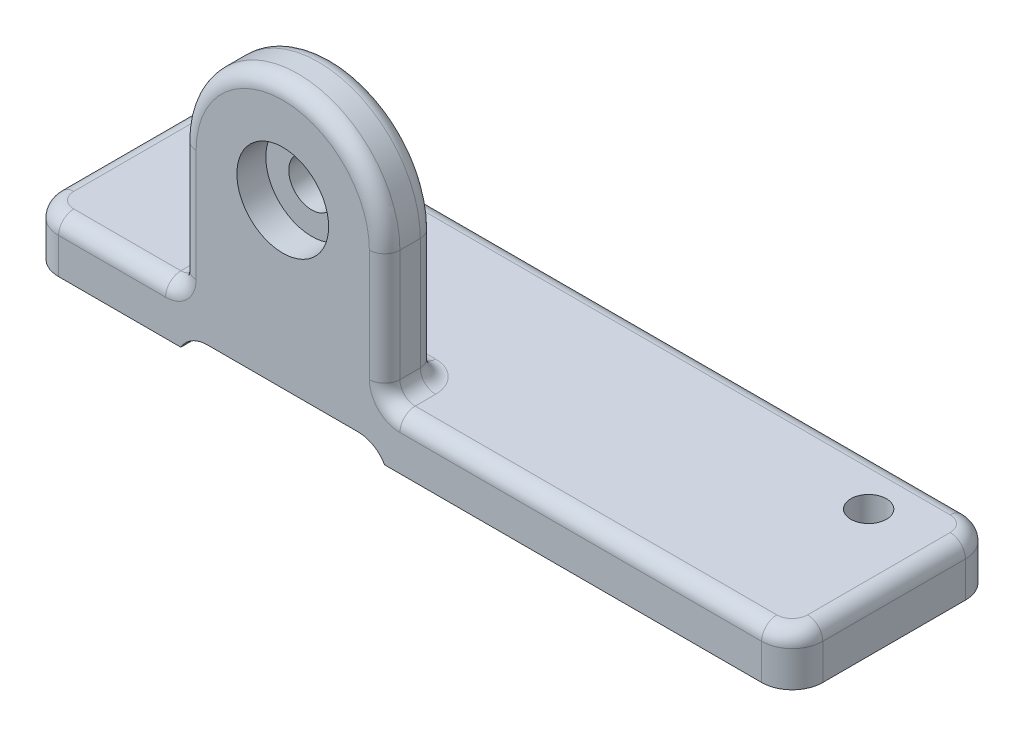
ISO-10303-21;
HEADER;
FILE_DESCRIPTION(('STEP AP214'),'2;1');
FILE_NAME('part.step','',(''),(''),'','','');
FILE_SCHEMA(('AUTOMOTIVE_DESIGN { 1 0 10303 214 1 1 1 1 }'));
ENDSEC;
DATA;
#1=APPLICATION_CONTEXT('core data for automotive mechanical design processes');
#2=APPLICATION_PROTOCOL_DEFINITION('international standard','automotive_design',2000,#1);
#3=PRODUCT_CONTEXT('',#1,'mechanical');
#4=PRODUCT('Part','Part','',(#3));
#5=PRODUCT_RELATED_PRODUCT_CATEGORY('part','',(#4));
#6=PRODUCT_DEFINITION_FORMATION('','',#4);
#7=PRODUCT_DEFINITION_CONTEXT('part definition',#1,'design');
#8=PRODUCT_DEFINITION('design','',#6,#7);
#9=PRODUCT_DEFINITION_SHAPE('','',#8);
#10=(LENGTH_UNIT() NAMED_UNIT(*) SI_UNIT(.MILLI.,.METRE.));
#11=(NAMED_UNIT(*) PLANE_ANGLE_UNIT() SI_UNIT($,.RADIAN.));
#12=(NAMED_UNIT(*) SI_UNIT($,.STERADIAN.) SOLID_ANGLE_UNIT());
#13=UNCERTAINTY_MEASURE_WITH_UNIT(LENGTH_MEASURE(1.E-05),#10,'distance_accuracy_value','');
#14=(GEOMETRIC_REPRESENTATION_CONTEXT(3) GLOBAL_UNCERTAINTY_ASSIGNED_CONTEXT((#13)) GLOBAL_UNIT_ASSIGNED_CONTEXT((#10,
#11,#12)) REPRESENTATION_CONTEXT('',''));
#15=CARTESIAN_POINT('',(0.,0.,0.));
#16=DIRECTION('',(0.,0.,1.));
#17=DIRECTION('',(1.,0.,0.));
#18=AXIS2_PLACEMENT_3D('',#15,#16,#17);
#19=CARTESIAN_POINT('',(0.,10.,-40.));
#20=DIRECTION('',(0.,-1.,0.));
#21=DIRECTION('',(0.,0.,-1.));
#22=AXIS2_PLACEMENT_3D('',#19,#20,#21);
#23=PLANE('',#22);
#24=DIRECTION('',(-1.,0.,0.));
#25=VECTOR('',#24,1.);
#26=CARTESIAN_POINT('',(0.,10.,-37.));
#27=LINE('',#26,#25);
#28=CARTESIAN_POINT('',(144.,10.,-37.));
#29=VERTEX_POINT('',#28);
#30=CARTESIAN_POINT('',(6.,10.,-37.));
#31=VERTEX_POINT('',#30);
#32=EDGE_CURVE('E334',#29,#31,#27,.T.);
#33=ORIENTED_EDGE('',*,*,#32,.T.);
#34=CARTESIAN_POINT('',(6.,10.,-34.));
#35=DIRECTION('',(0.,-1.,0.));
#36=DIRECTION('',(0.,0.,-1.));
#37=AXIS2_PLACEMENT_3D('',#34,#35,#36);
#38=CIRCLE('',#37,3.);
#39=CARTESIAN_POINT('',(3.,10.,-34.));
#40=VERTEX_POINT('',#39);
#41=EDGE_CURVE('E338',#31,#40,#38,.F.);
#42=ORIENTED_EDGE('',*,*,#41,.T.);
#43=DIRECTION('',(0.,0.,1.));
#44=VECTOR('',#43,1.);
#45=CARTESIAN_POINT('',(3.,10.,-40.));
#46=LINE('',#45,#44);
#47=CARTESIAN_POINT('',(3.,10.,-6.));
#48=VERTEX_POINT('',#47);
#49=EDGE_CURVE('E336',#40,#48,#46,.T.);
#50=ORIENTED_EDGE('',*,*,#49,.T.);
#51=CARTESIAN_POINT('',(6.,10.,-6.));
#52=DIRECTION('',(0.,-1.,0.));
#53=DIRECTION('',(0.,0.,-1.));
#54=AXIS2_PLACEMENT_3D('',#51,#52,#53);
#55=CIRCLE('',#54,3.);
#56=CARTESIAN_POINT('',(6.,10.,-3.));
#57=VERTEX_POINT('',#56);
#58=EDGE_CURVE('E332',#48,#57,#55,.F.);
#59=ORIENTED_EDGE('',*,*,#58,.T.);
#60=DIRECTION('',(1.,0.,0.));
#61=VECTOR('',#60,1.);
#62=CARTESIAN_POINT('',(0.,10.,-3.));
#63=LINE('',#62,#61);
#64=CARTESIAN_POINT('',(27.,10.,-3.));
#65=VERTEX_POINT('',#64);
#66=EDGE_CURVE('E328',#57,#65,#63,.T.);
#67=ORIENTED_EDGE('',*,*,#66,.T.);
#68=DIRECTION('',(0.,0.,-1.));
#69=VECTOR('',#68,1.);
#70=CARTESIAN_POINT('',(27.,10.,-40.));
#71=LINE('',#70,#69);
#72=CARTESIAN_POINT('',(27.,10.,-7.));
#73=VERTEX_POINT('',#72);
#74=EDGE_CURVE('E324',#65,#73,#71,.T.);
#75=ORIENTED_EDGE('',*,*,#74,.T.);
#76=CARTESIAN_POINT('',(33.,10.,-7.));
#77=DIRECTION('',(0.,-1.,0.));
#78=DIRECTION('',(0.,0.,-1.));
#79=AXIS2_PLACEMENT_3D('',#76,#77,#78);
#80=CIRCLE('',#79,6.);
#81=CARTESIAN_POINT('',(33.,10.,-13.));
#82=VERTEX_POINT('',#81);
#83=EDGE_CURVE('E321',#82,#73,#80,.F.);
#84=ORIENTED_EDGE('',*,*,#83,.F.);
#85=DIRECTION('',(1.,0.,0.));
#86=VECTOR('',#85,1.);
#87=CARTESIAN_POINT('',(0.,10.,-13.));
#88=LINE('',#87,#86);
#89=CARTESIAN_POINT('',(67.,10.,-13.));
#90=VERTEX_POINT('',#89);
#91=EDGE_CURVE('E317',#82,#90,#88,.T.);
#92=ORIENTED_EDGE('',*,*,#91,.T.);
#93=CARTESIAN_POINT('',(67.,10.,-7.));
#94=DIRECTION('',(0.,-1.,0.));
#95=DIRECTION('',(0.,0.,-1.));
#96=AXIS2_PLACEMENT_3D('',#93,#94,#95);
#97=CIRCLE('',#96,6.);
#98=CARTESIAN_POINT('',(73.,10.,-7.));
#99=VERTEX_POINT('',#98);
#100=EDGE_CURVE('E314',#99,#90,#97,.F.);
#101=ORIENTED_EDGE('',*,*,#100,.F.);
#102=DIRECTION('',(0.,0.,1.));
#103=VECTOR('',#102,1.);
#104=CARTESIAN_POINT('',(73.,10.,-40.));
#105=LINE('',#104,#103);
#106=CARTESIAN_POINT('',(73.,10.,-3.));
#107=VERTEX_POINT('',#106);
#108=EDGE_CURVE('E233',#99,#107,#105,.T.);
#109=ORIENTED_EDGE('',*,*,#108,.T.);
#110=DIRECTION('',(1.,0.,0.));
#111=VECTOR('',#110,1.);
#112=CARTESIAN_POINT('',(0.,10.,-3.));
#113=LINE('',#112,#111);
#114=CARTESIAN_POINT('',(144.,10.,-3.));
#115=VERTEX_POINT('',#114);
#116=EDGE_CURVE('E312',#107,#115,#113,.T.);
#117=ORIENTED_EDGE('',*,*,#116,.T.);
#118=CARTESIAN_POINT('',(144.,10.,-6.));
#119=DIRECTION('',(0.,-1.,0.));
#120=DIRECTION('',(0.,0.,-1.));
#121=AXIS2_PLACEMENT_3D('',#118,#119,#120);
#122=CIRCLE('',#121,3.);
#123=CARTESIAN_POINT('',(147.,10.,-6.));
#124=VERTEX_POINT('',#123);
#125=EDGE_CURVE('E319',#115,#124,#122,.F.);
#126=ORIENTED_EDGE('',*,*,#125,.T.);
#127=DIRECTION('',(0.,0.,-1.));
#128=VECTOR('',#127,1.);
#129=CARTESIAN_POINT('',(147.,10.,-40.));
#130=LINE('',#129,#128);
#131=CARTESIAN_POINT('',(147.,10.,-34.));
#132=VERTEX_POINT('',#131);
#133=EDGE_CURVE('E326',#124,#132,#130,.T.);
#134=ORIENTED_EDGE('',*,*,#133,.T.);
#135=CARTESIAN_POINT('',(144.,10.,-34.));
#136=DIRECTION('',(0.,-1.,0.));
#137=DIRECTION('',(0.,0.,-1.));
#138=AXIS2_PLACEMENT_3D('',#135,#136,#137);
#139=CIRCLE('',#138,3.);
#140=EDGE_CURVE('E330',#132,#29,#139,.F.);
#141=ORIENTED_EDGE('',*,*,#140,.T.);
#142=EDGE_LOOP('',(#33,#42,#50,#59,#67,#75,#84,#92,#101,#109,#117,#126,#134,#141));
#143=FACE_BOUND('',#142,.T.);
#144=CARTESIAN_POINT('',(135.,10.,-30.));
#145=DIRECTION('',(0.,1.,0.));
#146=DIRECTION('',(0.,0.,1.));
#147=AXIS2_PLACEMENT_3D('',#144,#145,#146);
#148=CIRCLE('',#147,3.49999999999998);
#149=CARTESIAN_POINT('',(135.,10.,-26.5));
#150=VERTEX_POINT('',#149);
#151=EDGE_CURVE('E274',#150,#150,#148,.T.);
#152=ORIENTED_EDGE('',*,*,#151,.F.);
#153=EDGE_LOOP('',(#152));
#154=FACE_BOUND('',#153,.T.);
#155=CARTESIAN_POINT('',(15.,10.,-30.));
#156=DIRECTION('',(0.,1.,0.));
#157=DIRECTION('',(0.,0.,1.));
#158=AXIS2_PLACEMENT_3D('',#155,#156,#157);
#159=CIRCLE('',#158,3.49999999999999);
#160=CARTESIAN_POINT('',(15.,10.,-26.5));
#161=VERTEX_POINT('',#160);
#162=EDGE_CURVE('E481',#161,#161,#159,.T.);
#163=ORIENTED_EDGE('',*,*,#162,.F.);
#164=EDGE_LOOP('',(#163));
#165=FACE_BOUND('',#164,.T.);
#166=ADVANCED_FACE('F36',(#143,#154,#165),#23,.F.);
#167=CARTESIAN_POINT('',(0.,0.,-40.));
#168=DIRECTION('',(0.,-1.,0.));
#169=DIRECTION('',(0.,0.,-1.));
#170=AXIS2_PLACEMENT_3D('',#167,#168,#169);
#171=PLANE('',#170);
#172=CARTESIAN_POINT('',(15.,0.,-30.));
#173=DIRECTION('',(0.,1.,0.));
#174=DIRECTION('',(0.,0.,1.));
#175=AXIS2_PLACEMENT_3D('',#172,#173,#174);
#176=CIRCLE('',#175,3.5);
#177=CARTESIAN_POINT('',(15.,0.,-26.5));
#178=VERTEX_POINT('',#177);
#179=EDGE_CURVE('E484',#178,#178,#176,.T.);
#180=ORIENTED_EDGE('',*,*,#179,.T.);
#181=EDGE_LOOP('',(#180));
#182=FACE_BOUND('',#181,.T.);
#183=DIRECTION('',(1.,0.,0.));
#184=VECTOR('',#183,1.);
#185=CARTESIAN_POINT('',(0.,0.,0.));
#186=LINE('',#185,#184);
#187=CARTESIAN_POINT('',(6.,0.,0.));
#188=VERTEX_POINT('',#187);
#189=CARTESIAN_POINT('',(30.,0.,0.));
#190=VERTEX_POINT('',#189);
#191=EDGE_CURVE('E266',#188,#190,#186,.T.);
#192=ORIENTED_EDGE('',*,*,#191,.F.);
#193=CARTESIAN_POINT('',(6.,0.,-6.));
#194=DIRECTION('',(0.,-1.,0.));
#195=DIRECTION('',(0.,0.,-1.));
#196=AXIS2_PLACEMENT_3D('',#193,#194,#195);
#197=CIRCLE('',#196,6.);
#198=CARTESIAN_POINT('',(0.,0.,-6.));
#199=VERTEX_POINT('',#198);
#200=EDGE_CURVE('E286',#188,#199,#197,.T.);
#201=ORIENTED_EDGE('',*,*,#200,.T.);
#202=DIRECTION('',(0.,0.,1.));
#203=VECTOR('',#202,1.);
#204=CARTESIAN_POINT('',(0.,0.,0.));
#205=LINE('',#204,#203);
#206=CARTESIAN_POINT('',(0.,0.,-34.));
#207=VERTEX_POINT('',#206);
#208=EDGE_CURVE('E261',#207,#199,#205,.T.);
#209=ORIENTED_EDGE('',*,*,#208,.F.);
#210=CARTESIAN_POINT('',(6.,0.,-34.));
#211=DIRECTION('',(0.,-1.,0.));
#212=DIRECTION('',(0.,0.,-1.));
#213=AXIS2_PLACEMENT_3D('',#210,#211,#212);
#214=CIRCLE('',#213,6.);
#215=CARTESIAN_POINT('',(6.,0.,-40.));
#216=VERTEX_POINT('',#215);
#217=EDGE_CURVE('E243',#207,#216,#214,.T.);
#218=ORIENTED_EDGE('',*,*,#217,.T.);
#219=DIRECTION('',(-1.,0.,0.));
#220=VECTOR('',#219,1.);
#221=CARTESIAN_POINT('',(0.,0.,-40.));
#222=LINE('',#221,#220);
#223=CARTESIAN_POINT('',(30.,0.,-40.));
#224=VERTEX_POINT('',#223);
#225=EDGE_CURVE('E226',#224,#216,#222,.T.);
#226=ORIENTED_EDGE('',*,*,#225,.F.);
#227=DIRECTION('',(0.,0.,1.));
#228=VECTOR('',#227,1.);
#229=CARTESIAN_POINT('',(30.,0.,-40.));
#230=LINE('',#229,#228);
#231=EDGE_CURVE('E240',#224,#190,#230,.T.);
#232=ORIENTED_EDGE('',*,*,#231,.T.);
#233=EDGE_LOOP('',(#192,#201,#209,#218,#226,#232));
#234=FACE_BOUND('',#233,.T.);
#235=ADVANCED_FACE('F239',(#182,#234),#171,.T.);
#236=CARTESIAN_POINT('',(0.,10.,0.));
#237=DIRECTION('',(1.,0.,0.));
#238=DIRECTION('',(0.,0.,-1.));
#239=AXIS2_PLACEMENT_3D('',#236,#237,#238);
#240=PLANE('',#239);
#241=DIRECTION('',(0.,-1.,0.));
#242=VECTOR('',#241,1.);
#243=CARTESIAN_POINT('',(0.,10.,-6.));
#244=LINE('',#243,#242);
#245=CARTESIAN_POINT('',(0.,7.,-6.));
#246=VERTEX_POINT('',#245);
#247=EDGE_CURVE('E290',#199,#246,#244,.F.);
#248=ORIENTED_EDGE('',*,*,#247,.T.);
#249=DIRECTION('',(0.,0.,1.));
#250=VECTOR('',#249,1.);
#251=CARTESIAN_POINT('',(0.,7.,0.));
#252=LINE('',#251,#250);
#253=CARTESIAN_POINT('',(0.,7.,-34.));
#254=VERTEX_POINT('',#253);
#255=EDGE_CURVE('E344',#246,#254,#252,.F.);
#256=ORIENTED_EDGE('',*,*,#255,.T.);
#257=DIRECTION('',(0.,-1.,0.));
#258=VECTOR('',#257,1.);
#259=CARTESIAN_POINT('',(0.,10.,-34.));
#260=LINE('',#259,#258);
#261=EDGE_CURVE('E288',#254,#207,#260,.T.);
#262=ORIENTED_EDGE('',*,*,#261,.T.);
#263=ORIENTED_EDGE('',*,*,#208,.T.);
#264=EDGE_LOOP('',(#248,#256,#262,#263));
#265=FACE_BOUND('',#264,.T.);
#266=ADVANCED_FACE('F500',(#265),#240,.F.);
#267=CARTESIAN_POINT('',(0.,10.,0.));
#268=DIRECTION('',(0.,0.,-1.));
#269=DIRECTION('',(-1.,0.,0.));
#270=AXIS2_PLACEMENT_3D('',#267,#268,#269);
#271=PLANE('',#270);
#272=CARTESIAN_POINT('',(50.,35.,0.));
#273=DIRECTION('',(0.,0.,1.));
#274=DIRECTION('',(1.,0.,0.));
#275=AXIS2_PLACEMENT_3D('',#272,#273,#274);
#276=CIRCLE('',#275,9.005);
#277=CARTESIAN_POINT('',(59.005,35.,0.));
#278=VERTEX_POINT('',#277);
#279=EDGE_CURVE('E275',#278,#278,#276,.T.);
#280=ORIENTED_EDGE('',*,*,#279,.F.);
#281=EDGE_LOOP('',(#280));
#282=FACE_BOUND('',#281,.T.);
#283=CARTESIAN_POINT('',(27.,13.,0.));
#284=DIRECTION('',(0.,0.,-1.));
#285=DIRECTION('',(-1.,0.,0.));
#286=AXIS2_PLACEMENT_3D('',#283,#284,#285);
#287=CIRCLE('',#286,6.);
#288=CARTESIAN_POINT('',(27.,7.,0.));
#289=VERTEX_POINT('',#288);
#290=CARTESIAN_POINT('',(33.,13.,0.));
#291=VERTEX_POINT('',#290);
#292=EDGE_CURVE('E363',#289,#291,#287,.F.);
#293=ORIENTED_EDGE('',*,*,#292,.F.);
#294=DIRECTION('',(1.,0.,0.));
#295=VECTOR('',#294,1.);
#296=CARTESIAN_POINT('',(0.,7.,0.));
#297=LINE('',#296,#295);
#298=CARTESIAN_POINT('',(6.,7.,0.));
#299=VERTEX_POINT('',#298);
#300=EDGE_CURVE('E366',#289,#299,#297,.F.);
#301=ORIENTED_EDGE('',*,*,#300,.T.);
#302=DIRECTION('',(0.,-1.,0.));
#303=VECTOR('',#302,1.);
#304=CARTESIAN_POINT('',(6.,10.,0.));
#305=LINE('',#304,#303);
#306=EDGE_CURVE('E283',#299,#188,#305,.T.);
#307=ORIENTED_EDGE('',*,*,#306,.T.);
#308=ORIENTED_EDGE('',*,*,#191,.T.);
#309=CARTESIAN_POINT('',(35.1961524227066,-3.,0.));
#310=DIRECTION('',(0.,0.,-1.));
#311=DIRECTION('',(-1.,0.,0.));
#312=AXIS2_PLACEMENT_3D('',#309,#310,#311);
#313=CIRCLE('',#312,6.);
#314=CARTESIAN_POINT('',(35.1961524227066,3.,0.));
#315=VERTEX_POINT('',#314);
#316=EDGE_CURVE('E234',#190,#315,#313,.T.);
#317=ORIENTED_EDGE('',*,*,#316,.T.);
#318=DIRECTION('',(-1.,0.,0.));
#319=VECTOR('',#318,1.);
#320=CARTESIAN_POINT('',(30.,3.,0.));
#321=LINE('',#320,#319);
#322=CARTESIAN_POINT('',(64.8038475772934,3.,0.));
#323=VERTEX_POINT('',#322);
#324=EDGE_CURVE('E254',#323,#315,#321,.T.);
#325=ORIENTED_EDGE('',*,*,#324,.F.);
#326=CARTESIAN_POINT('',(64.8038475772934,-3.,0.));
#327=DIRECTION('',(0.,0.,-1.));
#328=DIRECTION('',(-1.,0.,0.));
#329=AXIS2_PLACEMENT_3D('',#326,#327,#328);
#330=CIRCLE('',#329,6.);
#331=CARTESIAN_POINT('',(70.,0.,0.));
#332=VERTEX_POINT('',#331);
#333=EDGE_CURVE('E306',#323,#332,#330,.T.);
#334=ORIENTED_EDGE('',*,*,#333,.T.);
#335=CARTESIAN_POINT('',(144.,0.,0.));
#336=VERTEX_POINT('',#335);
#337=EDGE_CURVE('E265',#332,#336,#186,.T.);
#338=ORIENTED_EDGE('',*,*,#337,.T.);
#339=DIRECTION('',(0.,-1.,0.));
#340=VECTOR('',#339,1.);
#341=CARTESIAN_POINT('',(144.,10.,0.));
#342=LINE('',#341,#340);
#343=CARTESIAN_POINT('',(144.,7.,0.));
#344=VERTEX_POINT('',#343);
#345=EDGE_CURVE('E280',#336,#344,#342,.F.);
#346=ORIENTED_EDGE('',*,*,#345,.T.);
#347=DIRECTION('',(1.,0.,0.));
#348=VECTOR('',#347,1.);
#349=CARTESIAN_POINT('',(0.,7.,0.));
#350=LINE('',#349,#348);
#351=CARTESIAN_POINT('',(73.,7.,0.));
#352=VERTEX_POINT('',#351);
#353=EDGE_CURVE('E361',#344,#352,#350,.F.);
#354=ORIENTED_EDGE('',*,*,#353,.T.);
#355=CARTESIAN_POINT('',(73.,13.,0.));
#356=DIRECTION('',(0.,0.,-1.));
#357=DIRECTION('',(-1.,0.,0.));
#358=AXIS2_PLACEMENT_3D('',#355,#356,#357);
#359=CIRCLE('',#358,6.);
#360=CARTESIAN_POINT('',(67.,13.,0.));
#361=VERTEX_POINT('',#360);
#362=EDGE_CURVE('E358',#361,#352,#359,.F.);
#363=ORIENTED_EDGE('',*,*,#362,.F.);
#364=DIRECTION('',(0.,1.,0.));
#365=VECTOR('',#364,1.);
#366=CARTESIAN_POINT('',(67.,35.,0.));
#367=LINE('',#366,#365);
#368=CARTESIAN_POINT('',(67.,35.,0.));
#369=VERTEX_POINT('',#368);
#370=EDGE_CURVE('E356',#361,#369,#367,.T.);
#371=ORIENTED_EDGE('',*,*,#370,.T.);
#372=CARTESIAN_POINT('',(50.,35.,0.));
#373=DIRECTION('',(0.,0.,-1.));
#374=DIRECTION('',(-1.,0.,0.));
#375=AXIS2_PLACEMENT_3D('',#372,#373,#374);
#376=CIRCLE('',#375,17.);
#377=CARTESIAN_POINT('',(33.,35.,0.));
#378=VERTEX_POINT('',#377);
#379=EDGE_CURVE('E352',#369,#378,#376,.F.);
#380=ORIENTED_EDGE('',*,*,#379,.T.);
#381=DIRECTION('',(0.,-1.,0.));
#382=VECTOR('',#381,1.);
#383=CARTESIAN_POINT('',(33.,10.,0.));
#384=LINE('',#383,#382);
#385=EDGE_CURVE('E354',#378,#291,#384,.T.);
#386=ORIENTED_EDGE('',*,*,#385,.T.);
#387=EDGE_LOOP('',(#293,#301,#307,#308,#317,#325,#334,#338,#346,#354,#363,#371,#380,#386));
#388=FACE_BOUND('',#387,.T.);
#389=ADVANCED_FACE('F492',(#282,#388),#271,.F.);
#390=CARTESIAN_POINT('',(150.,10.,0.));
#391=DIRECTION('',(-1.,0.,0.));
#392=DIRECTION('',(0.,0.,1.));
#393=AXIS2_PLACEMENT_3D('',#390,#391,#392);
#394=PLANE('',#393);
#395=DIRECTION('',(0.,-1.,0.));
#396=VECTOR('',#395,1.);
#397=CARTESIAN_POINT('',(150.,10.,-34.));
#398=LINE('',#397,#396);
#399=CARTESIAN_POINT('',(150.,0.,-34.));
#400=VERTEX_POINT('',#399);
#401=CARTESIAN_POINT('',(150.,7.,-34.));
#402=VERTEX_POINT('',#401);
#403=EDGE_CURVE('E303',#400,#402,#398,.F.);
#404=ORIENTED_EDGE('',*,*,#403,.T.);
#405=DIRECTION('',(0.,0.,-1.));
#406=VECTOR('',#405,1.);
#407=CARTESIAN_POINT('',(150.,7.,0.));
#408=LINE('',#407,#406);
#409=CARTESIAN_POINT('',(150.,7.,-6.));
#410=VERTEX_POINT('',#409);
#411=EDGE_CURVE('E368',#402,#410,#408,.F.);
#412=ORIENTED_EDGE('',*,*,#411,.T.);
#413=DIRECTION('',(0.,-1.,0.));
#414=VECTOR('',#413,1.);
#415=CARTESIAN_POINT('',(150.,10.,-6.));
#416=LINE('',#415,#414);
#417=CARTESIAN_POINT('',(150.,0.,-6.));
#418=VERTEX_POINT('',#417);
#419=EDGE_CURVE('E301',#410,#418,#416,.T.);
#420=ORIENTED_EDGE('',*,*,#419,.T.);
#421=DIRECTION('',(0.,0.,-1.));
#422=VECTOR('',#421,1.);
#423=CARTESIAN_POINT('',(150.,0.,0.));
#424=LINE('',#423,#422);
#425=EDGE_CURVE('E245',#418,#400,#424,.T.);
#426=ORIENTED_EDGE('',*,*,#425,.T.);
#427=EDGE_LOOP('',(#404,#412,#420,#426));
#428=FACE_BOUND('',#427,.T.);
#429=ADVANCED_FACE('F544',(#428),#394,.F.);
#430=CARTESIAN_POINT('',(0.,10.,-40.));
#431=DIRECTION('',(0.,0.,1.));
#432=DIRECTION('',(1.,0.,0.));
#433=AXIS2_PLACEMENT_3D('',#430,#431,#432);
#434=PLANE('',#433);
#435=DIRECTION('',(0.,-1.,0.));
#436=VECTOR('',#435,1.);
#437=CARTESIAN_POINT('',(6.,10.,-40.));
#438=LINE('',#437,#436);
#439=CARTESIAN_POINT('',(6.,7.,-40.));
#440=VERTEX_POINT('',#439);
#441=EDGE_CURVE('E295',#216,#440,#438,.F.);
#442=ORIENTED_EDGE('',*,*,#441,.T.);
#443=DIRECTION('',(-1.,0.,0.));
#444=VECTOR('',#443,1.);
#445=CARTESIAN_POINT('',(0.,7.,-40.));
#446=LINE('',#445,#444);
#447=CARTESIAN_POINT('',(144.,7.,-40.));
#448=VERTEX_POINT('',#447);
#449=EDGE_CURVE('E346',#440,#448,#446,.F.);
#450=ORIENTED_EDGE('',*,*,#449,.T.);
#451=DIRECTION('',(0.,-1.,0.));
#452=VECTOR('',#451,1.);
#453=CARTESIAN_POINT('',(144.,10.,-40.));
#454=LINE('',#453,#452);
#455=CARTESIAN_POINT('',(144.,0.,-40.));
#456=VERTEX_POINT('',#455);
#457=EDGE_CURVE('E293',#448,#456,#454,.T.);
#458=ORIENTED_EDGE('',*,*,#457,.T.);
#459=CARTESIAN_POINT('',(70.,0.,-40.));
#460=VERTEX_POINT('',#459);
#461=EDGE_CURVE('E244',#456,#460,#222,.T.);
#462=ORIENTED_EDGE('',*,*,#461,.T.);
#463=CARTESIAN_POINT('',(64.8038475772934,-3.,-40.));
#464=DIRECTION('',(0.,0.,1.));
#465=DIRECTION('',(1.,0.,0.));
#466=AXIS2_PLACEMENT_3D('',#463,#464,#465);
#467=CIRCLE('',#466,6.);
#468=CARTESIAN_POINT('',(64.8038475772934,3.,-40.));
#469=VERTEX_POINT('',#468);
#470=EDGE_CURVE('E308',#460,#469,#467,.T.);
#471=ORIENTED_EDGE('',*,*,#470,.T.);
#472=DIRECTION('',(-1.,0.,0.));
#473=VECTOR('',#472,1.);
#474=CARTESIAN_POINT('',(30.,3.,-40.));
#475=LINE('',#474,#473);
#476=CARTESIAN_POINT('',(35.1961524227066,3.,-40.));
#477=VERTEX_POINT('',#476);
#478=EDGE_CURVE('E229',#469,#477,#475,.T.);
#479=ORIENTED_EDGE('',*,*,#478,.T.);
#480=CARTESIAN_POINT('',(35.1961524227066,-3.,-40.));
#481=DIRECTION('',(0.,0.,1.));
#482=DIRECTION('',(1.,0.,0.));
#483=AXIS2_PLACEMENT_3D('',#480,#481,#482);
#484=CIRCLE('',#483,6.);
#485=EDGE_CURVE('E222',#477,#224,#484,.T.);
#486=ORIENTED_EDGE('',*,*,#485,.T.);
#487=ORIENTED_EDGE('',*,*,#225,.T.);
#488=EDGE_LOOP('',(#442,#450,#458,#462,#471,#479,#486,#487));
#489=FACE_BOUND('',#488,.T.);
#490=ADVANCED_FACE('F225',(#489),#434,.F.);
#491=CARTESIAN_POINT('',(135.,0.,-30.));
#492=DIRECTION('',(0.,1.,0.));
#493=DIRECTION('',(0.,0.,1.));
#494=AXIS2_PLACEMENT_3D('',#491,#492,#493);
#495=CIRCLE('',#494,3.5);
#496=CARTESIAN_POINT('',(135.,0.,-26.5));
#497=VERTEX_POINT('',#496);
#498=EDGE_CURVE('E478',#497,#497,#495,.T.);
#499=ORIENTED_EDGE('',*,*,#498,.T.);
#500=EDGE_LOOP('',(#499));
#501=FACE_BOUND('',#500,.T.);
#502=ORIENTED_EDGE('',*,*,#461,.F.);
#503=CARTESIAN_POINT('',(144.,0.,-34.));
#504=DIRECTION('',(0.,-1.,0.));
#505=DIRECTION('',(0.,0.,-1.));
#506=AXIS2_PLACEMENT_3D('',#503,#504,#505);
#507=CIRCLE('',#506,6.);
#508=EDGE_CURVE('E299',#456,#400,#507,.T.);
#509=ORIENTED_EDGE('',*,*,#508,.T.);
#510=ORIENTED_EDGE('',*,*,#425,.F.);
#511=CARTESIAN_POINT('',(144.,0.,-6.));
#512=DIRECTION('',(0.,-1.,0.));
#513=DIRECTION('',(0.,0.,-1.));
#514=AXIS2_PLACEMENT_3D('',#511,#512,#513);
#515=CIRCLE('',#514,6.);
#516=EDGE_CURVE('E297',#418,#336,#515,.T.);
#517=ORIENTED_EDGE('',*,*,#516,.T.);
#518=ORIENTED_EDGE('',*,*,#337,.F.);
#519=DIRECTION('',(0.,0.,1.));
#520=VECTOR('',#519,1.);
#521=CARTESIAN_POINT('',(70.,0.,-40.));
#522=LINE('',#521,#520);
#523=EDGE_CURVE('E249',#460,#332,#522,.T.);
#524=ORIENTED_EDGE('',*,*,#523,.F.);
#525=EDGE_LOOP('',(#502,#509,#510,#517,#518,#524));
#526=FACE_BOUND('',#525,.T.);
#527=ADVANCED_FACE('F623',(#501,#526),#171,.T.);
#528=CARTESIAN_POINT('',(30.,0.,-10.));
#529=DIRECTION('',(-1.,0.,0.));
#530=DIRECTION('',(0.,-1.,0.));
#531=AXIS2_PLACEMENT_3D('',#528,#529,#530);
#532=PLANE('',#531);
#533=DIRECTION('',(0.,0.,1.));
#534=VECTOR('',#533,1.);
#535=CARTESIAN_POINT('',(30.,35.,-10.));
#536=LINE('',#535,#534);
#537=CARTESIAN_POINT('',(30.,35.,-7.));
#538=VERTEX_POINT('',#537);
#539=CARTESIAN_POINT('',(30.,35.,-3.));
#540=VERTEX_POINT('',#539);
#541=EDGE_CURVE('E258',#538,#540,#536,.T.);
#542=ORIENTED_EDGE('',*,*,#541,.F.);
#543=DIRECTION('',(0.,-1.,0.));
#544=VECTOR('',#543,1.);
#545=CARTESIAN_POINT('',(30.,0.,-7.));
#546=LINE('',#545,#544);
#547=CARTESIAN_POINT('',(30.,13.,-7.));
#548=VERTEX_POINT('',#547);
#549=EDGE_CURVE('E375',#538,#548,#546,.T.);
#550=ORIENTED_EDGE('',*,*,#549,.T.);
#551=DIRECTION('',(0.,0.,-1.));
#552=VECTOR('',#551,1.);
#553=CARTESIAN_POINT('',(30.,13.,-10.));
#554=LINE('',#553,#552);
#555=CARTESIAN_POINT('',(30.,13.,-3.));
#556=VERTEX_POINT('',#555);
#557=EDGE_CURVE('E372',#548,#556,#554,.F.);
#558=ORIENTED_EDGE('',*,*,#557,.T.);
#559=DIRECTION('',(0.,-1.,0.));
#560=VECTOR('',#559,1.);
#561=CARTESIAN_POINT('',(30.,35.,-3.));
#562=LINE('',#561,#560);
#563=EDGE_CURVE('E370',#556,#540,#562,.F.);
#564=ORIENTED_EDGE('',*,*,#563,.T.);
#565=EDGE_LOOP('',(#542,#550,#558,#564));
#566=FACE_BOUND('',#565,.T.);
#567=ADVANCED_FACE('F629',(#566),#532,.T.);
#568=CARTESIAN_POINT('',(70.,35.,-10.));
#569=DIRECTION('',(1.,0.,0.));
#570=DIRECTION('',(0.,0.,-1.));
#571=AXIS2_PLACEMENT_3D('',#568,#569,#570);
#572=PLANE('',#571);
#573=DIRECTION('',(0.,0.,1.));
#574=VECTOR('',#573,1.);
#575=CARTESIAN_POINT('',(70.,13.,-10.));
#576=LINE('',#575,#574);
#577=CARTESIAN_POINT('',(70.,13.,-3.));
#578=VERTEX_POINT('',#577);
#579=CARTESIAN_POINT('',(70.,13.,-7.));
#580=VERTEX_POINT('',#579);
#581=EDGE_CURVE('E53',#578,#580,#576,.F.);
#582=ORIENTED_EDGE('',*,*,#581,.T.);
#583=DIRECTION('',(0.,1.,0.));
#584=VECTOR('',#583,1.);
#585=CARTESIAN_POINT('',(70.,35.,-7.));
#586=LINE('',#585,#584);
#587=CARTESIAN_POINT('',(70.,35.,-7.));
#588=VERTEX_POINT('',#587);
#589=EDGE_CURVE('E390',#580,#588,#586,.T.);
#590=ORIENTED_EDGE('',*,*,#589,.T.);
#591=DIRECTION('',(0.,0.,1.));
#592=VECTOR('',#591,1.);
#593=CARTESIAN_POINT('',(70.,35.,-10.));
#594=LINE('',#593,#592);
#595=CARTESIAN_POINT('',(70.,35.,-3.));
#596=VERTEX_POINT('',#595);
#597=EDGE_CURVE('E252',#588,#596,#594,.T.);
#598=ORIENTED_EDGE('',*,*,#597,.T.);
#599=DIRECTION('',(0.,1.,0.));
#600=VECTOR('',#599,1.);
#601=CARTESIAN_POINT('',(70.,10.,-3.));
#602=LINE('',#601,#600);
#603=EDGE_CURVE('E58',#596,#578,#602,.F.);
#604=ORIENTED_EDGE('',*,*,#603,.T.);
#605=EDGE_LOOP('',(#582,#590,#598,#604));
#606=FACE_BOUND('',#605,.T.);
#607=ADVANCED_FACE('F625',(#606),#572,.T.);
#608=CARTESIAN_POINT('',(50.,35.,-10.));
#609=DIRECTION('',(0.,0.,-1.));
#610=DIRECTION('',(-1.,0.,0.));
#611=AXIS2_PLACEMENT_3D('',#608,#609,#610);
#612=PLANE('',#611);
#613=DIRECTION('',(0.,1.,0.));
#614=VECTOR('',#613,1.);
#615=CARTESIAN_POINT('',(67.,35.,-10.));
#616=LINE('',#615,#614);
#617=CARTESIAN_POINT('',(67.,35.,-10.));
#618=VERTEX_POINT('',#617);
#619=CARTESIAN_POINT('',(67.,13.,-10.));
#620=VERTEX_POINT('',#619);
#621=EDGE_CURVE('E383',#618,#620,#616,.F.);
#622=ORIENTED_EDGE('',*,*,#621,.T.);
#623=DIRECTION('',(1.,0.,0.));
#624=VECTOR('',#623,1.);
#625=CARTESIAN_POINT('',(50.,13.,-10.));
#626=LINE('',#625,#624);
#627=CARTESIAN_POINT('',(33.,13.,-10.));
#628=VERTEX_POINT('',#627);
#629=EDGE_CURVE('E385',#620,#628,#626,.F.);
#630=ORIENTED_EDGE('',*,*,#629,.T.);
#631=DIRECTION('',(0.,-1.,0.));
#632=VECTOR('',#631,1.);
#633=CARTESIAN_POINT('',(33.,35.,-10.));
#634=LINE('',#633,#632);
#635=CARTESIAN_POINT('',(33.,35.,-10.));
#636=VERTEX_POINT('',#635);
#637=EDGE_CURVE('E381',#628,#636,#634,.F.);
#638=ORIENTED_EDGE('',*,*,#637,.T.);
#639=CARTESIAN_POINT('',(50.,35.,-10.));
#640=DIRECTION('',(0.,0.,-1.));
#641=DIRECTION('',(-1.,0.,0.));
#642=AXIS2_PLACEMENT_3D('',#639,#640,#641);
#643=CIRCLE('',#642,17.);
#644=EDGE_CURVE('E379',#636,#618,#643,.T.);
#645=ORIENTED_EDGE('',*,*,#644,.T.);
#646=EDGE_LOOP('',(#622,#630,#638,#645));
#647=FACE_BOUND('',#646,.T.);
#648=CARTESIAN_POINT('',(50.,35.,-10.));
#649=DIRECTION('',(0.,0.,-1.));
#650=DIRECTION('',(-1.,0.,0.));
#651=AXIS2_PLACEMENT_3D('',#648,#649,#650);
#652=CIRCLE('',#651,4.5);
#653=CARTESIAN_POINT('',(45.5,35.,-10.));
#654=VERTEX_POINT('',#653);
#655=EDGE_CURVE('E271',#654,#654,#652,.T.);
#656=ORIENTED_EDGE('',*,*,#655,.F.);
#657=EDGE_LOOP('',(#656));
#658=FACE_BOUND('',#657,.T.);
#659=ADVANCED_FACE('F695',(#647,#658),#612,.T.);
#660=CARTESIAN_POINT('',(50.,35.,-10.));
#661=DIRECTION('',(0.,0.,1.));
#662=DIRECTION('',(1.,0.,0.));
#663=AXIS2_PLACEMENT_3D('',#660,#661,#662);
#664=CYLINDRICAL_SURFACE('',#663,20.);
#665=ORIENTED_EDGE('',*,*,#597,.F.);
#666=CARTESIAN_POINT('',(50.,35.,-7.));
#667=DIRECTION('',(0.,0.,-1.));
#668=DIRECTION('',(-1.,0.,0.));
#669=AXIS2_PLACEMENT_3D('',#666,#667,#668);
#670=CIRCLE('',#669,20.);
#671=EDGE_CURVE('E11',#588,#538,#670,.F.);
#672=ORIENTED_EDGE('',*,*,#671,.T.);
#673=ORIENTED_EDGE('',*,*,#541,.T.);
#674=CARTESIAN_POINT('',(50.,35.,-3.));
#675=DIRECTION('',(0.,0.,-1.));
#676=DIRECTION('',(-1.,0.,0.));
#677=AXIS2_PLACEMENT_3D('',#674,#675,#676);
#678=CIRCLE('',#677,20.);
#679=EDGE_CURVE('E45',#540,#596,#678,.T.);
#680=ORIENTED_EDGE('',*,*,#679,.T.);
#681=EDGE_LOOP('',(#665,#672,#673,#680));
#682=FACE_BOUND('',#681,.T.);
#683=ADVANCED_FACE('F700',(#682),#664,.T.);
#684=CARTESIAN_POINT('',(30.,3.,-40.));
#685=DIRECTION('',(0.,1.,0.));
#686=DIRECTION('',(0.,0.,1.));
#687=AXIS2_PLACEMENT_3D('',#684,#685,#686);
#688=PLANE('',#687);
#689=ORIENTED_EDGE('',*,*,#478,.F.);
#690=DIRECTION('',(0.,0.,-1.));
#691=VECTOR('',#690,1.);
#692=CARTESIAN_POINT('',(64.8038475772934,3.,-40.));
#693=LINE('',#692,#691);
#694=EDGE_CURVE('E277',#469,#323,#693,.F.);
#695=ORIENTED_EDGE('',*,*,#694,.T.);
#696=ORIENTED_EDGE('',*,*,#324,.T.);
#697=DIRECTION('',(0.,0.,1.));
#698=VECTOR('',#697,1.);
#699=CARTESIAN_POINT('',(35.1961524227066,3.,-40.));
#700=LINE('',#699,#698);
#701=EDGE_CURVE('E270',#315,#477,#700,.F.);
#702=ORIENTED_EDGE('',*,*,#701,.T.);
#703=EDGE_LOOP('',(#689,#695,#696,#702));
#704=FACE_BOUND('',#703,.T.);
#705=ADVANCED_FACE('F489',(#704),#688,.F.);
#706=CARTESIAN_POINT('',(15.,10.,-30.));
#707=DIRECTION('',(0.,1.,0.));
#708=DIRECTION('',(0.,0.,1.));
#709=AXIS2_PLACEMENT_3D('',#706,#707,#708);
#710=CYLINDRICAL_SURFACE('',#709,3.49999999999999);
#711=ORIENTED_EDGE('',*,*,#179,.F.);
#712=EDGE_LOOP('',(#711));
#713=FACE_BOUND('',#712,.T.);
#714=ORIENTED_EDGE('',*,*,#162,.T.);
#715=EDGE_LOOP('',(#714));
#716=FACE_BOUND('',#715,.T.);
#717=ADVANCED_FACE('F715',(#713,#716),#710,.F.);
#718=CARTESIAN_POINT('',(135.,10.,-30.));
#719=DIRECTION('',(0.,1.,0.));
#720=DIRECTION('',(0.,0.,1.));
#721=AXIS2_PLACEMENT_3D('',#718,#719,#720);
#722=CYLINDRICAL_SURFACE('',#721,3.49999999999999);
#723=ORIENTED_EDGE('',*,*,#498,.F.);
#724=EDGE_LOOP('',(#723));
#725=FACE_BOUND('',#724,.T.);
#726=ORIENTED_EDGE('',*,*,#151,.T.);
#727=EDGE_LOOP('',(#726));
#728=FACE_BOUND('',#727,.T.);
#729=ADVANCED_FACE('F818',(#725,#728),#722,.F.);
#730=CARTESIAN_POINT('',(50.,35.,0.));
#731=DIRECTION('',(0.,0.,1.));
#732=DIRECTION('',(1.,0.,0.));
#733=AXIS2_PLACEMENT_3D('',#730,#731,#732);
#734=CYLINDRICAL_SURFACE('',#733,9.005);
#735=CARTESIAN_POINT('',(50.,35.,-5.68));
#736=DIRECTION('',(0.,0.,1.));
#737=DIRECTION('',(1.,0.,0.));
#738=AXIS2_PLACEMENT_3D('',#735,#736,#737);
#739=CIRCLE('',#738,9.005);
#740=CARTESIAN_POINT('',(59.005,35.,-5.68));
#741=VERTEX_POINT('',#740);
#742=EDGE_CURVE('E467',#741,#741,#739,.T.);
#743=ORIENTED_EDGE('',*,*,#742,.F.);
#744=EDGE_LOOP('',(#743));
#745=FACE_BOUND('',#744,.T.);
#746=ORIENTED_EDGE('',*,*,#279,.T.);
#747=EDGE_LOOP('',(#746));
#748=FACE_BOUND('',#747,.T.);
#749=ADVANCED_FACE('F808',(#745,#748),#734,.F.);
#750=CARTESIAN_POINT('',(54.5,35.,-5.68));
#751=DIRECTION('',(0.,0.,-1.));
#752=DIRECTION('',(-1.,0.,0.));
#753=AXIS2_PLACEMENT_3D('',#750,#751,#752);
#754=PLANE('',#753);
#755=CARTESIAN_POINT('',(50.,35.,-5.68));
#756=DIRECTION('',(0.,0.,1.));
#757=DIRECTION('',(1.,0.,0.));
#758=AXIS2_PLACEMENT_3D('',#755,#756,#757);
#759=CIRCLE('',#758,4.5);
#760=CARTESIAN_POINT('',(54.5,35.,-5.68));
#761=VERTEX_POINT('',#760);
#762=EDGE_CURVE('E461',#761,#761,#759,.T.);
#763=ORIENTED_EDGE('',*,*,#762,.F.);
#764=EDGE_LOOP('',(#763));
#765=FACE_BOUND('',#764,.T.);
#766=ORIENTED_EDGE('',*,*,#742,.T.);
#767=EDGE_LOOP('',(#766));
#768=FACE_BOUND('',#767,.T.);
#769=ADVANCED_FACE('F798',(#765,#768),#754,.F.);
#770=CARTESIAN_POINT('',(50.,35.,0.));
#771=DIRECTION('',(0.,0.,1.));
#772=DIRECTION('',(1.,0.,0.));
#773=AXIS2_PLACEMENT_3D('',#770,#771,#772);
#774=CYLINDRICAL_SURFACE('',#773,4.5);
#775=ORIENTED_EDGE('',*,*,#655,.T.);
#776=EDGE_LOOP('',(#775));
#777=FACE_BOUND('',#776,.T.);
#778=ORIENTED_EDGE('',*,*,#762,.T.);
#779=EDGE_LOOP('',(#778));
#780=FACE_BOUND('',#779,.T.);
#781=ADVANCED_FACE('F643',(#777,#780),#774,.F.);
#782=CARTESIAN_POINT('',(64.8038475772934,-3.,-40.));
#783=DIRECTION('',(0.,0.,-1.));
#784=DIRECTION('',(-1.,0.,0.));
#785=AXIS2_PLACEMENT_3D('',#782,#783,#784);
#786=CYLINDRICAL_SURFACE('',#785,6.);
#787=ORIENTED_EDGE('',*,*,#470,.F.);
#788=ORIENTED_EDGE('',*,*,#523,.T.);
#789=ORIENTED_EDGE('',*,*,#333,.F.);
#790=ORIENTED_EDGE('',*,*,#694,.F.);
#791=EDGE_LOOP('',(#787,#788,#789,#790));
#792=FACE_BOUND('',#791,.T.);
#793=ADVANCED_FACE('F640',(#792),#786,.F.);
#794=CARTESIAN_POINT('',(35.1961524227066,-3.,-40.));
#795=DIRECTION('',(0.,0.,1.));
#796=DIRECTION('',(1.,0.,0.));
#797=AXIS2_PLACEMENT_3D('',#794,#795,#796);
#798=CYLINDRICAL_SURFACE('',#797,6.);
#799=ORIENTED_EDGE('',*,*,#485,.F.);
#800=ORIENTED_EDGE('',*,*,#701,.F.);
#801=ORIENTED_EDGE('',*,*,#316,.F.);
#802=ORIENTED_EDGE('',*,*,#231,.F.);
#803=EDGE_LOOP('',(#799,#800,#801,#802));
#804=FACE_BOUND('',#803,.T.);
#805=ADVANCED_FACE('F247',(#804),#798,.F.);
#806=CARTESIAN_POINT('',(6.,10.,-6.));
#807=DIRECTION('',(0.,-1.,0.));
#808=DIRECTION('',(0.,0.,-1.));
#809=AXIS2_PLACEMENT_3D('',#806,#807,#808);
#810=CYLINDRICAL_SURFACE('',#809,6.);
#811=ORIENTED_EDGE('',*,*,#306,.F.);
#812=CARTESIAN_POINT('',(6.,7.,-6.));
#813=DIRECTION('',(0.,-1.,0.));
#814=DIRECTION('',(0.,0.,-1.));
#815=AXIS2_PLACEMENT_3D('',#812,#813,#814);
#816=CIRCLE('',#815,6.);
#817=EDGE_CURVE('E348',#299,#246,#816,.T.);
#818=ORIENTED_EDGE('',*,*,#817,.T.);
#819=ORIENTED_EDGE('',*,*,#247,.F.);
#820=ORIENTED_EDGE('',*,*,#200,.F.);
#821=EDGE_LOOP('',(#811,#818,#819,#820));
#822=FACE_BOUND('',#821,.T.);
#823=ADVANCED_FACE('F503',(#822),#810,.T.);
#824=CARTESIAN_POINT('',(6.,10.,-34.));
#825=DIRECTION('',(0.,-1.,0.));
#826=DIRECTION('',(0.,0.,-1.));
#827=AXIS2_PLACEMENT_3D('',#824,#825,#826);
#828=CYLINDRICAL_SURFACE('',#827,6.);
#829=ORIENTED_EDGE('',*,*,#261,.F.);
#830=CARTESIAN_POINT('',(6.,7.,-34.));
#831=DIRECTION('',(0.,-1.,0.));
#832=DIRECTION('',(0.,0.,-1.));
#833=AXIS2_PLACEMENT_3D('',#830,#831,#832);
#834=CIRCLE('',#833,6.);
#835=EDGE_CURVE('E341',#254,#440,#834,.T.);
#836=ORIENTED_EDGE('',*,*,#835,.T.);
#837=ORIENTED_EDGE('',*,*,#441,.F.);
#838=ORIENTED_EDGE('',*,*,#217,.F.);
#839=EDGE_LOOP('',(#829,#836,#837,#838));
#840=FACE_BOUND('',#839,.T.);
#841=ADVANCED_FACE('F516',(#840),#828,.T.);
#842=CARTESIAN_POINT('',(144.,10.,-34.));
#843=DIRECTION('',(0.,-1.,0.));
#844=DIRECTION('',(0.,0.,-1.));
#845=AXIS2_PLACEMENT_3D('',#842,#843,#844);
#846=CYLINDRICAL_SURFACE('',#845,6.);
#847=ORIENTED_EDGE('',*,*,#457,.F.);
#848=CARTESIAN_POINT('',(144.,7.,-34.));
#849=DIRECTION('',(0.,-1.,0.));
#850=DIRECTION('',(0.,0.,-1.));
#851=AXIS2_PLACEMENT_3D('',#848,#849,#850);
#852=CIRCLE('',#851,6.);
#853=EDGE_CURVE('E350',#448,#402,#852,.T.);
#854=ORIENTED_EDGE('',*,*,#853,.T.);
#855=ORIENTED_EDGE('',*,*,#403,.F.);
#856=ORIENTED_EDGE('',*,*,#508,.F.);
#857=EDGE_LOOP('',(#847,#854,#855,#856));
#858=FACE_BOUND('',#857,.T.);
#859=ADVANCED_FACE('F530',(#858),#846,.T.);
#860=CARTESIAN_POINT('',(144.,10.,-6.));
#861=DIRECTION('',(0.,-1.,0.));
#862=DIRECTION('',(0.,0.,-1.));
#863=AXIS2_PLACEMENT_3D('',#860,#861,#862);
#864=CYLINDRICAL_SURFACE('',#863,6.);
#865=ORIENTED_EDGE('',*,*,#419,.F.);
#866=CARTESIAN_POINT('',(144.,7.,-6.));
#867=DIRECTION('',(0.,-1.,0.));
#868=DIRECTION('',(0.,0.,-1.));
#869=AXIS2_PLACEMENT_3D('',#866,#867,#868);
#870=CIRCLE('',#869,6.);
#871=EDGE_CURVE('E377',#410,#344,#870,.T.);
#872=ORIENTED_EDGE('',*,*,#871,.T.);
#873=ORIENTED_EDGE('',*,*,#345,.F.);
#874=ORIENTED_EDGE('',*,*,#516,.F.);
#875=EDGE_LOOP('',(#865,#872,#873,#874));
#876=FACE_BOUND('',#875,.T.);
#877=ADVANCED_FACE('F548',(#876),#864,.T.);
#878=CARTESIAN_POINT('',(67.,35.,-7.));
#879=DIRECTION('',(0.,1.,0.));
#880=DIRECTION('',(0.,0.,1.));
#881=AXIS2_PLACEMENT_3D('',#878,#879,#880);
#882=CYLINDRICAL_SURFACE('',#881,3.);
#883=CARTESIAN_POINT('',(67.,13.,-7.));
#884=DIRECTION('',(0.,-1.,0.));
#885=DIRECTION('',(0.,0.,-1.));
#886=AXIS2_PLACEMENT_3D('',#883,#884,#885);
#887=CIRCLE('',#886,3.);
#888=EDGE_CURVE('E40',#620,#580,#887,.T.);
#889=ORIENTED_EDGE('',*,*,#888,.F.);
#890=ORIENTED_EDGE('',*,*,#621,.F.);
#891=CARTESIAN_POINT('',(67.,35.,-7.));
#892=DIRECTION('',(0.,1.,0.));
#893=DIRECTION('',(0.,0.,1.));
#894=AXIS2_PLACEMENT_3D('',#891,#892,#893);
#895=CIRCLE('',#894,3.);
#896=EDGE_CURVE('E454',#588,#618,#895,.T.);
#897=ORIENTED_EDGE('',*,*,#896,.F.);
#898=ORIENTED_EDGE('',*,*,#589,.F.);
#899=EDGE_LOOP('',(#889,#890,#897,#898));
#900=FACE_BOUND('',#899,.T.);
#901=ADVANCED_FACE('F38',(#900),#882,.T.);
#902=CARTESIAN_POINT('',(67.,13.,-7.));
#903=DIRECTION('',(0.,-1.,0.));
#904=DIRECTION('',(0.,0.,-1.));
#905=AXIS2_PLACEMENT_3D('',#902,#903,#904);
#906=TOROIDAL_SURFACE('',#905,6.,3.);
#907=CARTESIAN_POINT('',(67.,13.,-13.));
#908=DIRECTION('',(-1.,0.,0.));
#909=DIRECTION('',(0.,0.,1.));
#910=AXIS2_PLACEMENT_3D('',#907,#908,#909);
#911=CIRCLE('',#910,3.);
#912=EDGE_CURVE('E449',#620,#90,#911,.F.);
#913=ORIENTED_EDGE('',*,*,#912,.F.);
#914=ORIENTED_EDGE('',*,*,#888,.T.);
#915=CARTESIAN_POINT('',(73.,13.,-7.));
#916=DIRECTION('',(0.,0.,1.));
#917=DIRECTION('',(1.,0.,0.));
#918=AXIS2_PLACEMENT_3D('',#915,#916,#917);
#919=CIRCLE('',#918,3.);
#920=EDGE_CURVE('E452',#99,#580,#919,.F.);
#921=ORIENTED_EDGE('',*,*,#920,.F.);
#922=ORIENTED_EDGE('',*,*,#100,.T.);
#923=EDGE_LOOP('',(#913,#914,#921,#922));
#924=FACE_BOUND('',#923,.T.);
#925=ADVANCED_FACE('F602',(#924),#906,.F.);
#926=CARTESIAN_POINT('',(50.,35.,-7.));
#927=DIRECTION('',(0.,0.,-1.));
#928=DIRECTION('',(-1.,0.,0.));
#929=AXIS2_PLACEMENT_3D('',#926,#927,#928);
#930=TOROIDAL_SURFACE('',#929,17.,3.);
#931=ORIENTED_EDGE('',*,*,#896,.T.);
#932=ORIENTED_EDGE('',*,*,#644,.F.);
#933=CARTESIAN_POINT('',(33.,35.,-7.));
#934=DIRECTION('',(0.,-1.,0.));
#935=DIRECTION('',(0.,0.,-1.));
#936=AXIS2_PLACEMENT_3D('',#933,#934,#935);
#937=CIRCLE('',#936,3.);
#938=EDGE_CURVE('E446',#538,#636,#937,.T.);
#939=ORIENTED_EDGE('',*,*,#938,.F.);
#940=ORIENTED_EDGE('',*,*,#671,.F.);
#941=EDGE_LOOP('',(#931,#932,#939,#940));
#942=FACE_BOUND('',#941,.T.);
#943=ADVANCED_FACE('F607',(#942),#930,.T.);
#944=CARTESIAN_POINT('',(73.,13.,-40.));
#945=DIRECTION('',(0.,0.,1.));
#946=DIRECTION('',(1.,0.,0.));
#947=AXIS2_PLACEMENT_3D('',#944,#945,#946);
#948=CYLINDRICAL_SURFACE('',#947,3.);
#949=ORIENTED_EDGE('',*,*,#920,.T.);
#950=ORIENTED_EDGE('',*,*,#581,.F.);
#951=CARTESIAN_POINT('',(73.,13.,-3.));
#952=DIRECTION('',(0.,0.,-1.));
#953=DIRECTION('',(-1.,0.,0.));
#954=AXIS2_PLACEMENT_3D('',#951,#952,#953);
#955=CIRCLE('',#954,3.);
#956=EDGE_CURVE('E440',#107,#578,#955,.T.);
#957=ORIENTED_EDGE('',*,*,#956,.F.);
#958=ORIENTED_EDGE('',*,*,#108,.F.);
#959=EDGE_LOOP('',(#949,#950,#957,#958));
#960=FACE_BOUND('',#959,.T.);
#961=ADVANCED_FACE('F605',(#960),#948,.F.);
#962=CARTESIAN_POINT('',(0.,13.,-13.));
#963=DIRECTION('',(1.,0.,0.));
#964=DIRECTION('',(0.,0.,-1.));
#965=AXIS2_PLACEMENT_3D('',#962,#963,#964);
#966=CYLINDRICAL_SURFACE('',#965,3.);
#967=ORIENTED_EDGE('',*,*,#912,.T.);
#968=ORIENTED_EDGE('',*,*,#91,.F.);
#969=CARTESIAN_POINT('',(33.,13.,-13.));
#970=DIRECTION('',(1.,0.,0.));
#971=DIRECTION('',(0.,0.,-1.));
#972=AXIS2_PLACEMENT_3D('',#969,#970,#971);
#973=CIRCLE('',#972,3.);
#974=EDGE_CURVE('E437',#628,#82,#973,.T.);
#975=ORIENTED_EDGE('',*,*,#974,.F.);
#976=ORIENTED_EDGE('',*,*,#629,.F.);
#977=EDGE_LOOP('',(#967,#968,#975,#976));
#978=FACE_BOUND('',#977,.T.);
#979=ADVANCED_FACE('F599',(#978),#966,.F.);
#980=CARTESIAN_POINT('',(33.,0.,-7.));
#981=DIRECTION('',(0.,-1.,0.));
#982=DIRECTION('',(1.,0.,0.));
#983=AXIS2_PLACEMENT_3D('',#980,#981,#982);
#984=CYLINDRICAL_SURFACE('',#983,3.);
#985=ORIENTED_EDGE('',*,*,#938,.T.);
#986=ORIENTED_EDGE('',*,*,#637,.F.);
#987=CARTESIAN_POINT('',(33.,13.,-7.));
#988=DIRECTION('',(0.,-1.,0.));
#989=DIRECTION('',(0.,0.,-1.));
#990=AXIS2_PLACEMENT_3D('',#987,#988,#989);
#991=CIRCLE('',#990,3.);
#992=EDGE_CURVE('E435',#548,#628,#991,.T.);
#993=ORIENTED_EDGE('',*,*,#992,.F.);
#994=ORIENTED_EDGE('',*,*,#549,.F.);
#995=EDGE_LOOP('',(#985,#986,#993,#994));
#996=FACE_BOUND('',#995,.T.);
#997=ADVANCED_FACE('F613',(#996),#984,.T.);
#998=CARTESIAN_POINT('',(67.,10.,-3.));
#999=DIRECTION('',(0.,-1.,0.));
#1000=DIRECTION('',(0.,0.,-1.));
#1001=AXIS2_PLACEMENT_3D('',#998,#999,#1000);
#1002=CYLINDRICAL_SURFACE('',#1001,3.);
#1003=CARTESIAN_POINT('',(67.,35.,-3.));
#1004=DIRECTION('',(0.,1.,0.));
#1005=DIRECTION('',(0.,0.,1.));
#1006=AXIS2_PLACEMENT_3D('',#1003,#1004,#1005);
#1007=CIRCLE('',#1006,3.);
#1008=EDGE_CURVE('E432',#369,#596,#1007,.T.);
#1009=ORIENTED_EDGE('',*,*,#1008,.F.);
#1010=ORIENTED_EDGE('',*,*,#370,.F.);
#1011=CARTESIAN_POINT('',(67.,13.,-3.));
#1012=DIRECTION('',(0.,-1.,0.));
#1013=DIRECTION('',(0.,0.,-1.));
#1014=AXIS2_PLACEMENT_3D('',#1011,#1012,#1013);
#1015=CIRCLE('',#1014,3.);
#1016=EDGE_CURVE('E443',#578,#361,#1015,.T.);
#1017=ORIENTED_EDGE('',*,*,#1016,.F.);
#1018=ORIENTED_EDGE('',*,*,#603,.F.);
#1019=EDGE_LOOP('',(#1009,#1010,#1017,#1018));
#1020=FACE_BOUND('',#1019,.T.);
#1021=ADVANCED_FACE('F567',(#1020),#1002,.T.);
#1022=CARTESIAN_POINT('',(73.,13.,-3.));
#1023=DIRECTION('',(0.,0.,-1.));
#1024=DIRECTION('',(-1.,0.,0.));
#1025=AXIS2_PLACEMENT_3D('',#1022,#1023,#1024);
#1026=TOROIDAL_SURFACE('',#1025,6.,3.);
#1027=ORIENTED_EDGE('',*,*,#1016,.T.);
#1028=ORIENTED_EDGE('',*,*,#362,.T.);
#1029=CARTESIAN_POINT('',(73.,7.,-3.));
#1030=DIRECTION('',(-1.,0.,0.));
#1031=DIRECTION('',(0.,0.,1.));
#1032=AXIS2_PLACEMENT_3D('',#1029,#1030,#1031);
#1033=CIRCLE('',#1032,3.);
#1034=EDGE_CURVE('E429',#107,#352,#1033,.F.);
#1035=ORIENTED_EDGE('',*,*,#1034,.F.);
#1036=ORIENTED_EDGE('',*,*,#956,.T.);
#1037=EDGE_LOOP('',(#1027,#1028,#1035,#1036));
#1038=FACE_BOUND('',#1037,.T.);
#1039=ADVANCED_FACE('F562',(#1038),#1026,.T.);
#1040=CARTESIAN_POINT('',(33.,13.,-7.));
#1041=DIRECTION('',(0.,-1.,0.));
#1042=DIRECTION('',(0.,0.,-1.));
#1043=AXIS2_PLACEMENT_3D('',#1040,#1041,#1042);
#1044=TOROIDAL_SURFACE('',#1043,6.,3.);
#1045=ORIENTED_EDGE('',*,*,#974,.T.);
#1046=ORIENTED_EDGE('',*,*,#83,.T.);
#1047=CARTESIAN_POINT('',(27.,13.,-7.));
#1048=DIRECTION('',(0.,0.,1.));
#1049=DIRECTION('',(1.,0.,0.));
#1050=AXIS2_PLACEMENT_3D('',#1047,#1048,#1049);
#1051=CIRCLE('',#1050,3.);
#1052=EDGE_CURVE('E426',#548,#73,#1051,.F.);
#1053=ORIENTED_EDGE('',*,*,#1052,.F.);
#1054=ORIENTED_EDGE('',*,*,#992,.T.);
#1055=EDGE_LOOP('',(#1045,#1046,#1053,#1054));
#1056=FACE_BOUND('',#1055,.T.);
#1057=ADVANCED_FACE('F594',(#1056),#1044,.F.);
#1058=CARTESIAN_POINT('',(50.,35.,-3.));
#1059=DIRECTION('',(0.,0.,-1.));
#1060=DIRECTION('',(-1.,0.,0.));
#1061=AXIS2_PLACEMENT_3D('',#1058,#1059,#1060);
#1062=TOROIDAL_SURFACE('',#1061,17.,3.);
#1063=ORIENTED_EDGE('',*,*,#1008,.T.);
#1064=ORIENTED_EDGE('',*,*,#679,.F.);
#1065=CARTESIAN_POINT('',(33.,35.,-3.));
#1066=DIRECTION('',(0.,-1.,0.));
#1067=DIRECTION('',(0.,0.,-1.));
#1068=AXIS2_PLACEMENT_3D('',#1065,#1066,#1067);
#1069=CIRCLE('',#1068,3.);
#1070=EDGE_CURVE('E423',#378,#540,#1069,.T.);
#1071=ORIENTED_EDGE('',*,*,#1070,.F.);
#1072=ORIENTED_EDGE('',*,*,#379,.F.);
#1073=EDGE_LOOP('',(#1063,#1064,#1071,#1072));
#1074=FACE_BOUND('',#1073,.T.);
#1075=ADVANCED_FACE('F574',(#1074),#1062,.T.);
#1076=CARTESIAN_POINT('',(0.,7.,-3.));
#1077=DIRECTION('',(1.,0.,0.));
#1078=DIRECTION('',(0.,0.,-1.));
#1079=AXIS2_PLACEMENT_3D('',#1076,#1077,#1078);
#1080=CYLINDRICAL_SURFACE('',#1079,3.);
#1081=ORIENTED_EDGE('',*,*,#1034,.T.);
#1082=ORIENTED_EDGE('',*,*,#353,.F.);
#1083=CARTESIAN_POINT('',(144.,7.,-3.));
#1084=DIRECTION('',(1.,0.,0.));
#1085=DIRECTION('',(0.,0.,-1.));
#1086=AXIS2_PLACEMENT_3D('',#1083,#1084,#1085);
#1087=CIRCLE('',#1086,3.);
#1088=EDGE_CURVE('E420',#115,#344,#1087,.T.);
#1089=ORIENTED_EDGE('',*,*,#1088,.F.);
#1090=ORIENTED_EDGE('',*,*,#116,.F.);
#1091=EDGE_LOOP('',(#1081,#1082,#1089,#1090));
#1092=FACE_BOUND('',#1091,.T.);
#1093=ADVANCED_FACE('F558',(#1092),#1080,.T.);
#1094=CARTESIAN_POINT('',(27.,13.,-40.));
#1095=DIRECTION('',(0.,0.,-1.));
#1096=DIRECTION('',(-1.,0.,0.));
#1097=AXIS2_PLACEMENT_3D('',#1094,#1095,#1096);
#1098=CYLINDRICAL_SURFACE('',#1097,3.);
#1099=ORIENTED_EDGE('',*,*,#1052,.T.);
#1100=ORIENTED_EDGE('',*,*,#74,.F.);
#1101=CARTESIAN_POINT('',(27.,13.,-3.));
#1102=DIRECTION('',(0.,0.,-1.));
#1103=DIRECTION('',(-1.,0.,0.));
#1104=AXIS2_PLACEMENT_3D('',#1101,#1102,#1103);
#1105=CIRCLE('',#1104,3.);
#1106=EDGE_CURVE('E417',#556,#65,#1105,.T.);
#1107=ORIENTED_EDGE('',*,*,#1106,.F.);
#1108=ORIENTED_EDGE('',*,*,#557,.F.);
#1109=EDGE_LOOP('',(#1099,#1100,#1107,#1108));
#1110=FACE_BOUND('',#1109,.T.);
#1111=ADVANCED_FACE('F590',(#1110),#1098,.F.);
#1112=CARTESIAN_POINT('',(33.,10.,-3.));
#1113=DIRECTION('',(0.,1.,0.));
#1114=DIRECTION('',(-1.,0.,0.));
#1115=AXIS2_PLACEMENT_3D('',#1112,#1113,#1114);
#1116=CYLINDRICAL_SURFACE('',#1115,3.);
#1117=ORIENTED_EDGE('',*,*,#1070,.T.);
#1118=ORIENTED_EDGE('',*,*,#563,.F.);
#1119=CARTESIAN_POINT('',(33.,13.,-3.));
#1120=DIRECTION('',(0.,-1.,0.));
#1121=DIRECTION('',(0.,0.,-1.));
#1122=AXIS2_PLACEMENT_3D('',#1119,#1120,#1121);
#1123=CIRCLE('',#1122,3.);
#1124=EDGE_CURVE('E415',#291,#556,#1123,.T.);
#1125=ORIENTED_EDGE('',*,*,#1124,.F.);
#1126=ORIENTED_EDGE('',*,*,#385,.F.);
#1127=EDGE_LOOP('',(#1117,#1118,#1125,#1126));
#1128=FACE_BOUND('',#1127,.T.);
#1129=ADVANCED_FACE('F577',(#1128),#1116,.T.);
#1130=CARTESIAN_POINT('',(144.,7.,-6.));
#1131=DIRECTION('',(0.,-1.,0.));
#1132=DIRECTION('',(0.,0.,-1.));
#1133=AXIS2_PLACEMENT_3D('',#1130,#1131,#1132);
#1134=DEGENERATE_TOROIDAL_SURFACE('',#1133,3.,3.,.T.);
#1135=ORIENTED_EDGE('',*,*,#1088,.T.);
#1136=ORIENTED_EDGE('',*,*,#871,.F.);
#1137=CARTESIAN_POINT('',(147.,7.,-6.));
#1138=DIRECTION('',(0.,0.,-1.));
#1139=DIRECTION('',(-1.,0.,0.));
#1140=AXIS2_PLACEMENT_3D('',#1137,#1138,#1139);
#1141=CIRCLE('',#1140,3.);
#1142=EDGE_CURVE('E412',#124,#410,#1141,.T.);
#1143=ORIENTED_EDGE('',*,*,#1142,.F.);
#1144=ORIENTED_EDGE('',*,*,#125,.F.);
#1145=EDGE_LOOP('',(#1135,#1136,#1143,#1144));
#1146=FACE_BOUND('',#1145,.T.);
#1147=ADVANCED_FACE('F552',(#1146),#1134,.T.);
#1148=CARTESIAN_POINT('',(27.,13.,-3.));
#1149=DIRECTION('',(0.,0.,-1.));
#1150=DIRECTION('',(-1.,0.,0.));
#1151=AXIS2_PLACEMENT_3D('',#1148,#1149,#1150);
#1152=TOROIDAL_SURFACE('',#1151,6.,3.);
#1153=ORIENTED_EDGE('',*,*,#1124,.T.);
#1154=ORIENTED_EDGE('',*,*,#1106,.T.);
#1155=CARTESIAN_POINT('',(27.,7.,-3.));
#1156=DIRECTION('',(1.,0.,0.));
#1157=DIRECTION('',(0.,0.,-1.));
#1158=AXIS2_PLACEMENT_3D('',#1155,#1156,#1157);
#1159=CIRCLE('',#1158,3.);
#1160=EDGE_CURVE('E409',#289,#65,#1159,.F.);
#1161=ORIENTED_EDGE('',*,*,#1160,.F.);
#1162=ORIENTED_EDGE('',*,*,#292,.T.);
#1163=EDGE_LOOP('',(#1153,#1154,#1161,#1162));
#1164=FACE_BOUND('',#1163,.T.);
#1165=ADVANCED_FACE('F581',(#1164),#1152,.T.);
#1166=CARTESIAN_POINT('',(147.,7.,-40.));
#1167=DIRECTION('',(0.,0.,-1.));
#1168=DIRECTION('',(-1.,0.,0.));
#1169=AXIS2_PLACEMENT_3D('',#1166,#1167,#1168);
#1170=CYLINDRICAL_SURFACE('',#1169,3.);
#1171=ORIENTED_EDGE('',*,*,#1142,.T.);
#1172=ORIENTED_EDGE('',*,*,#411,.F.);
#1173=CARTESIAN_POINT('',(147.,7.,-34.));
#1174=DIRECTION('',(0.,0.,-1.));
#1175=DIRECTION('',(-1.,0.,0.));
#1176=AXIS2_PLACEMENT_3D('',#1173,#1174,#1175);
#1177=CIRCLE('',#1176,3.);
#1178=EDGE_CURVE('E406',#132,#402,#1177,.T.);
#1179=ORIENTED_EDGE('',*,*,#1178,.F.);
#1180=ORIENTED_EDGE('',*,*,#133,.F.);
#1181=EDGE_LOOP('',(#1171,#1172,#1179,#1180));
#1182=FACE_BOUND('',#1181,.T.);
#1183=ADVANCED_FACE('F540',(#1182),#1170,.T.);
#1184=CARTESIAN_POINT('',(0.,7.,-3.));
#1185=DIRECTION('',(1.,0.,0.));
#1186=DIRECTION('',(0.,0.,-1.));
#1187=AXIS2_PLACEMENT_3D('',#1184,#1185,#1186);
#1188=CYLINDRICAL_SURFACE('',#1187,3.);
#1189=ORIENTED_EDGE('',*,*,#1160,.T.);
#1190=ORIENTED_EDGE('',*,*,#66,.F.);
#1191=CARTESIAN_POINT('',(6.,7.,-3.));
#1192=DIRECTION('',(-1.,0.,0.));
#1193=DIRECTION('',(0.,0.,1.));
#1194=AXIS2_PLACEMENT_3D('',#1191,#1192,#1193);
#1195=CIRCLE('',#1194,3.);
#1196=EDGE_CURVE('E403',#299,#57,#1195,.T.);
#1197=ORIENTED_EDGE('',*,*,#1196,.F.);
#1198=ORIENTED_EDGE('',*,*,#300,.F.);
#1199=EDGE_LOOP('',(#1189,#1190,#1197,#1198));
#1200=FACE_BOUND('',#1199,.T.);
#1201=ADVANCED_FACE('F584',(#1200),#1188,.T.);
#1202=CARTESIAN_POINT('',(144.,7.,-34.));
#1203=DIRECTION('',(0.,-1.,0.));
#1204=DIRECTION('',(0.,0.,-1.));
#1205=AXIS2_PLACEMENT_3D('',#1202,#1203,#1204);
#1206=DEGENERATE_TOROIDAL_SURFACE('',#1205,3.,3.,.T.);
#1207=ORIENTED_EDGE('',*,*,#1178,.T.);
#1208=ORIENTED_EDGE('',*,*,#853,.F.);
#1209=CARTESIAN_POINT('',(144.,7.,-37.));
#1210=DIRECTION('',(-1.,0.,0.));
#1211=DIRECTION('',(0.,0.,1.));
#1212=AXIS2_PLACEMENT_3D('',#1209,#1210,#1211);
#1213=CIRCLE('',#1212,3.);
#1214=EDGE_CURVE('E400',#29,#448,#1213,.T.);
#1215=ORIENTED_EDGE('',*,*,#1214,.F.);
#1216=ORIENTED_EDGE('',*,*,#140,.F.);
#1217=EDGE_LOOP('',(#1207,#1208,#1215,#1216));
#1218=FACE_BOUND('',#1217,.T.);
#1219=ADVANCED_FACE('F534',(#1218),#1206,.T.);
#1220=CARTESIAN_POINT('',(6.,7.,-6.));
#1221=DIRECTION('',(0.,-1.,0.));
#1222=DIRECTION('',(0.,0.,-1.));
#1223=AXIS2_PLACEMENT_3D('',#1220,#1221,#1222);
#1224=DEGENERATE_TOROIDAL_SURFACE('',#1223,3.,3.,.T.);
#1225=ORIENTED_EDGE('',*,*,#1196,.T.);
#1226=ORIENTED_EDGE('',*,*,#58,.F.);
#1227=CARTESIAN_POINT('',(3.,7.,-6.));
#1228=DIRECTION('',(0.,0.,-1.));
#1229=DIRECTION('',(-1.,0.,0.));
#1230=AXIS2_PLACEMENT_3D('',#1227,#1228,#1229);
#1231=CIRCLE('',#1230,3.);
#1232=EDGE_CURVE('E397',#246,#48,#1231,.T.);
#1233=ORIENTED_EDGE('',*,*,#1232,.F.);
#1234=ORIENTED_EDGE('',*,*,#817,.F.);
#1235=EDGE_LOOP('',(#1225,#1226,#1233,#1234));
#1236=FACE_BOUND('',#1235,.T.);
#1237=ADVANCED_FACE('F507',(#1236),#1224,.T.);
#1238=CARTESIAN_POINT('',(0.,7.,-37.));
#1239=DIRECTION('',(-1.,0.,0.));
#1240=DIRECTION('',(0.,0.,1.));
#1241=AXIS2_PLACEMENT_3D('',#1238,#1239,#1240);
#1242=CYLINDRICAL_SURFACE('',#1241,3.);
#1243=ORIENTED_EDGE('',*,*,#1214,.T.);
#1244=ORIENTED_EDGE('',*,*,#449,.F.);
#1245=CARTESIAN_POINT('',(6.,7.,-37.));
#1246=DIRECTION('',(-1.,0.,0.));
#1247=DIRECTION('',(0.,0.,1.));
#1248=AXIS2_PLACEMENT_3D('',#1245,#1246,#1247);
#1249=CIRCLE('',#1248,3.);
#1250=EDGE_CURVE('E395',#31,#440,#1249,.T.);
#1251=ORIENTED_EDGE('',*,*,#1250,.F.);
#1252=ORIENTED_EDGE('',*,*,#32,.F.);
#1253=EDGE_LOOP('',(#1243,#1244,#1251,#1252));
#1254=FACE_BOUND('',#1253,.T.);
#1255=ADVANCED_FACE('F524',(#1254),#1242,.T.);
#1256=CARTESIAN_POINT('',(3.,7.,-40.));
#1257=DIRECTION('',(0.,0.,1.));
#1258=DIRECTION('',(1.,0.,0.));
#1259=AXIS2_PLACEMENT_3D('',#1256,#1257,#1258);
#1260=CYLINDRICAL_SURFACE('',#1259,3.);
#1261=ORIENTED_EDGE('',*,*,#1232,.T.);
#1262=ORIENTED_EDGE('',*,*,#49,.F.);
#1263=CARTESIAN_POINT('',(3.,7.,-34.));
#1264=DIRECTION('',(0.,0.,-1.));
#1265=DIRECTION('',(-1.,0.,0.));
#1266=AXIS2_PLACEMENT_3D('',#1263,#1264,#1265);
#1267=CIRCLE('',#1266,3.);
#1268=EDGE_CURVE('E393',#254,#40,#1267,.T.);
#1269=ORIENTED_EDGE('',*,*,#1268,.F.);
#1270=ORIENTED_EDGE('',*,*,#255,.F.);
#1271=EDGE_LOOP('',(#1261,#1262,#1269,#1270));
#1272=FACE_BOUND('',#1271,.T.);
#1273=ADVANCED_FACE('F513',(#1272),#1260,.T.);
#1274=CARTESIAN_POINT('',(6.,7.,-34.));
#1275=DIRECTION('',(0.,-1.,0.));
#1276=DIRECTION('',(0.,0.,-1.));
#1277=AXIS2_PLACEMENT_3D('',#1274,#1275,#1276);
#1278=DEGENERATE_TOROIDAL_SURFACE('',#1277,3.,3.,.T.);
#1279=ORIENTED_EDGE('',*,*,#1250,.T.);
#1280=ORIENTED_EDGE('',*,*,#835,.F.);
#1281=ORIENTED_EDGE('',*,*,#1268,.T.);
#1282=ORIENTED_EDGE('',*,*,#41,.F.);
#1283=EDGE_LOOP('',(#1279,#1280,#1281,#1282));
#1284=FACE_BOUND('',#1283,.T.);
#1285=ADVANCED_FACE('F518',(#1284),#1278,.T.);
#1286=CLOSED_SHELL('',(#166,#235,#266,#389,#429,#490,#527,#567,#607,#659,#683,#705,#717,#729,
#749,#769,#781,#793,#805,#823,#841,#859,#877,#901,#925,#943,#961,#979,#997,#1021,#1039,#1057,
#1075,#1093,#1111,#1129,#1147,#1165,#1183,#1201,#1219,#1237,#1255,#1273,#1285));
#1287=MANIFOLD_SOLID_BREP('B2',#1286);
#1288=ADVANCED_BREP_SHAPE_REPRESENTATION('',(#18,#1287),#14);
#1289=SHAPE_DEFINITION_REPRESENTATION(#9,#1288);
ENDSEC;
END-ISO-10303-21;
